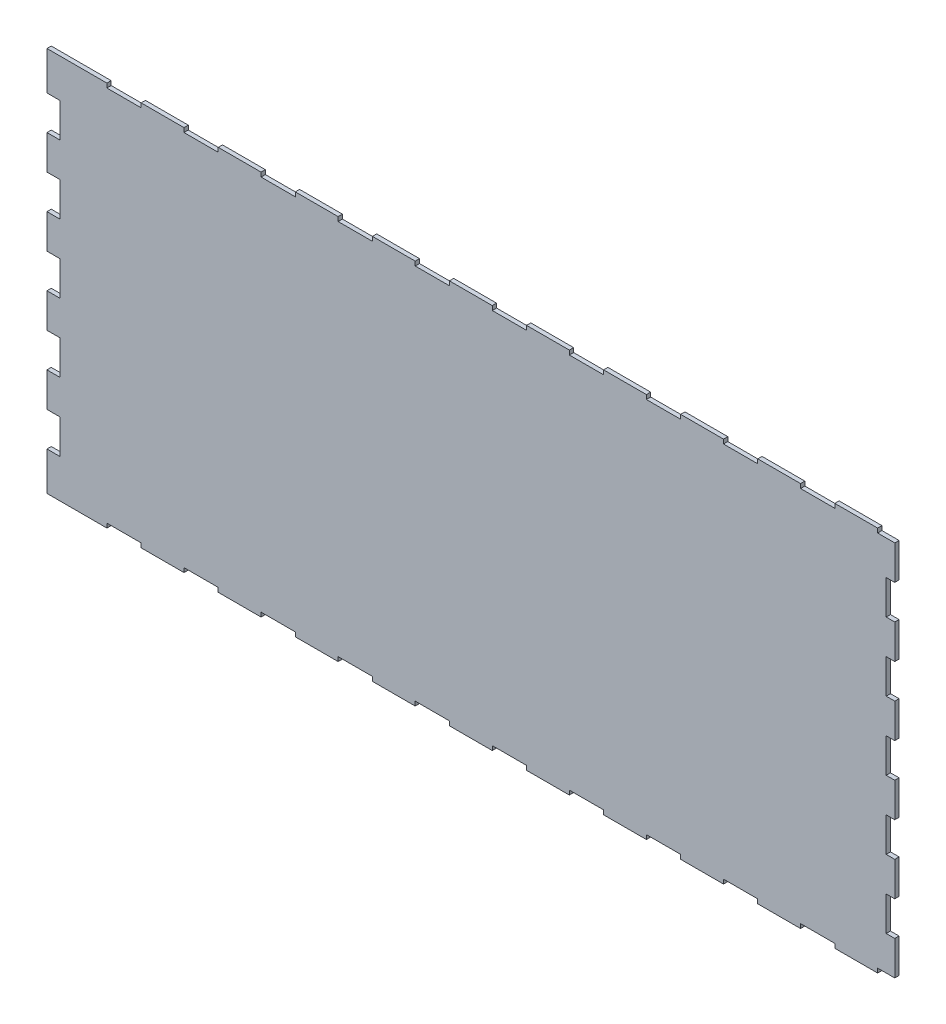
from build123d import *

# Parameters (mm, degrees)
BOSS_EXTRUDE1_DEPTH = 5
CUT_EXTRUDE1_DEPTH  = 928.712239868


with BuildPart() as part:
    # Model → Boss-Extrude1 (new body)
    with BuildSketch(Plane.XY):
        Polygon((900, 180), (885, 180), (885, 140), (900, 140), (900, 100), (885, 100), (885, 60), (900, 60), (900, 20), (885, 20), (885, -20), (900, -20), (900, -60), (885, -60), (885, -100), (900, -100), (900, -140), (885, -140), (885, -180), (900, -180), (900, -225), (830, -225), (830, -220), (790, -220), (790, -225), (740, -225), (740, -220), (700, -220), (700, -225), (650, -225), (650, -220), (610, -220), (610, -225), (560, -225), (560, -220), (520, -220), (520, -225), (470, -225), (470, -220), (430, -220), (430, -225), (380, -225), (380, -220), (340, -220), (340, -225), (290, -225), (290, -220), (250, -220), (250, -225), (200, -225), (200, -220), (160, -220), (160, -225), (110, -225), (110, -220), (70, -220), (70, -225), (20, -225), (20, -220), (-20, -220), (-20, -225), (-70, -225), (-70, -220), (-110, -220), (-110, -225), (-160, -225), (-160, -220), (-200, -220), (-200, -225), (-250, -225), (-250, -220), (-290, -220), (-290, -225), (-340, -225), (-340, -220), (-380, -220), (-380, -225), (-430, -225), (-430, -220), (-470, -220), (-470, -225), (-520, -225), (-520, -220), (-560, -220), (-560, -225), (-610, -225), (-610, -220), (-650, -220), (-650, -225), (-700, -225), (-700, -220), (-740, -220), (-740, -225), (-790, -225), (-790, -220), (-830, -220), (-830, -225), (-900, -225), (-900, -180), (-885, -180), (-885, -140), (-900, -140), (-900, -100), (-885, -100), (-885, -60), (-900, -60), (-900, -20), (-885, -20), (-885, 20), (-900, 20), (-900, 60), (-885, 60), (-885, 100), (-900, 100), (-900, 140), (-885, 140), (-885, 180), (-900, 180), (-900, 225), (-830, 225), (-830, 220), (-790, 220), (-790, 225), (-740, 225), (-740, 220), (-700, 220), (-700, 225), (-650, 225), (-650, 220), (-610, 220), (-610, 225), (-560, 225), (-560, 220), (-520, 220), (-520, 225), (-470, 225), (-470, 220), (-430, 220), (-430, 225), (-380, 225), (-380, 220), (-340, 220), (-340, 225), (-290, 225), (-290, 220), (-250, 220), (-250, 225), (-200, 225), (-200, 220), (-160, 220), (-160, 225), (-110, 225), (-110, 220), (-70, 220), (-70, 225), (-20, 225), (-20, 220), (20, 220), (20, 225), (70, 225), (70, 220), (110, 220), (110, 225), (160, 225), (160, 220), (200, 220), (200, 225), (250, 225), (250, 220), (290, 220), (290, 225), (340, 225), (340, 220), (380, 220), (380, 225), (430, 225), (430, 220), (470, 220), (470, 225), (520, 225), (520, 220), (560, 220), (560, 225), (610, 225), (610, 220), (650, 220), (650, 225), (700, 225), (700, 220), (740, 220), (740, 225), (790, 225), (790, 220), (830, 220), (830, 225), (900, 225), align=None)
    extrude(amount=BOSS_EXTRUDE1_DEPTH)

    # Sketch1 → Cut-Extrude1 (cut, through all)
    with BuildSketch(Plane.XY.offset(5)):
        Polygon((90, 220), (90, 180), (80, 180), (80, 140), (90, 140), (90, 100), (80, 100), (80, 60), (90, 60), (90, 20), (80, 20), (80, -20), (90, -20), (90, -60), (80, -60), (80, -100), (90, -100), (90, -140), (80, -140), (80, -180), (90, -180), (90, -220), (1000.887593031, -705.749009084), (1149.935386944, 540.832540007), align=None)
    extrude(amount=-CUT_EXTRUDE1_DEPTH, mode=Mode.SUBTRACT)


solid = part.part
